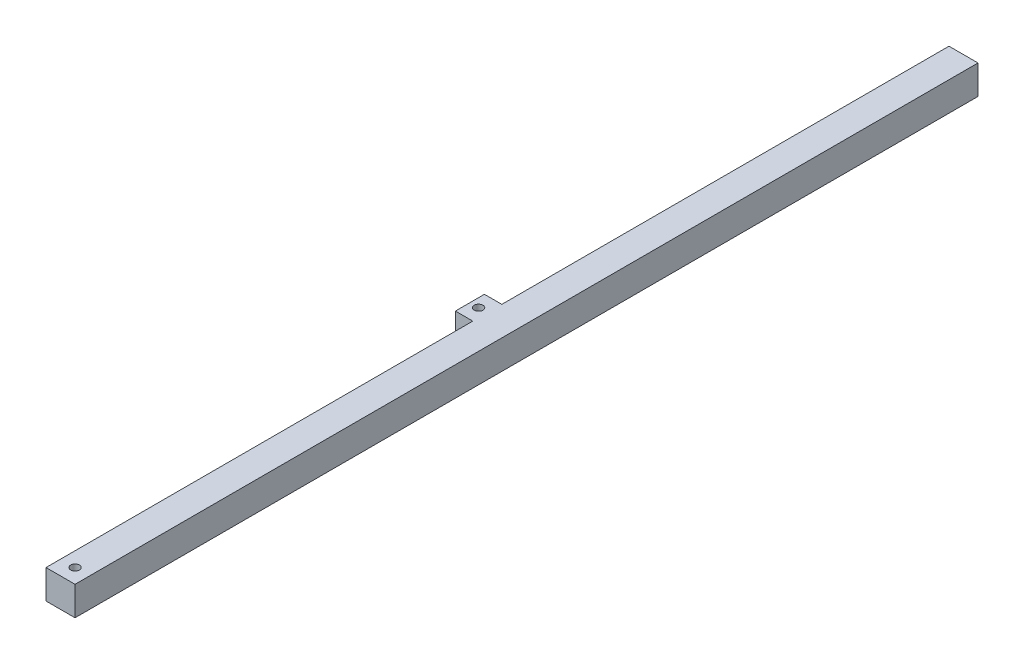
from build123d import *

# Parameters (mm, degrees)
BASE_EXTRUSION_DEPTH    = 150.5
ESQUISSE2_W             = 5
ESQUISSE2_H             = 5
BOSS_EXTRU_1_DEPTH      = 5
ESQUISSE3_R             = 0.75
ENL_V_MAT_EXTRU_1_DEPTH = 156.660688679
ESQUISSE4_W             = 5
ESQUISSE4_H             = 5
BOSS_EXTRU_2_DEPTH      = 3
ESQUISSE5_R             = 0.75
ENL_V_MAT_EXTRU_2_DEPTH = 156.660688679


with BuildPart() as part:
    # Esquisse1 → Base-Extrusion (new body)
    with BuildSketch(Plane.XY):
        Polygon((0, 0), (0, 5), (5, 5), (5, 0), (4, 0), (4, 4), (1, 4), (1, 0), align=None)
    extrude(amount=BASE_EXTRUSION_DEPTH)

    # Esquisse2 → Boss.-Extru.1 (add)
    with BuildSketch(Plane.XY.offset(150.5)):
        with Locations((2.5, 2.5)):
            Rectangle(ESQUISSE2_W, ESQUISSE2_H)
    extrude(amount=BOSS_EXTRU_1_DEPTH)

    # Esquisse3 → Enl_v. mat.-Extru.1 (cut, through all)
    with BuildSketch(Plane.XZ):
        with Locations((2.5, 153)):
            Circle(ESQUISSE3_R)
    extrude(amount=-ENL_V_MAT_EXTRU_1_DEPTH, mode=Mode.SUBTRACT)

    # Esquisse4 → Boss.-Extru.2 (add)
    with BuildSketch(Plane.ZY):
        with Locations((79.5, 2.5)):
            Rectangle(ESQUISSE4_W, ESQUISSE4_H)
    extrude(amount=BOSS_EXTRU_2_DEPTH)

    # Esquisse5 → Enl_v. mat.-Extru.2 (cut, through all)
    with BuildSketch(Plane.XZ):
        with Locations((-1.5, 79.5)):
            Circle(ESQUISSE5_R)
    extrude(amount=-ENL_V_MAT_EXTRU_2_DEPTH, mode=Mode.SUBTRACT)


solid = part.part
